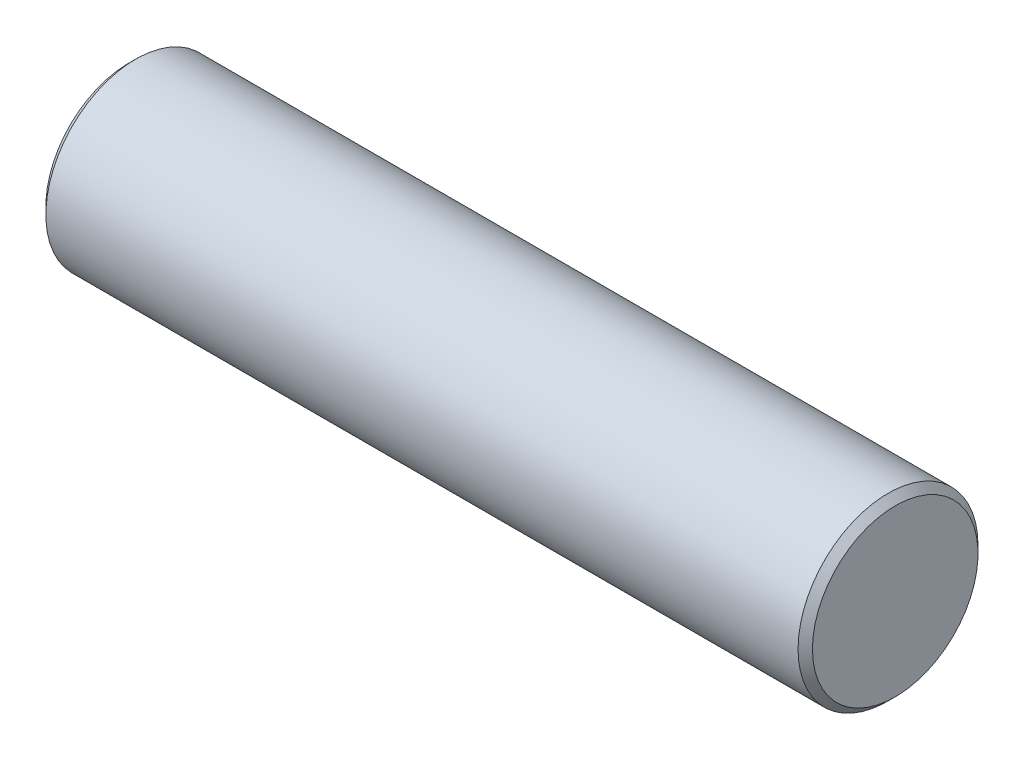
ISO-10303-21;
HEADER;
FILE_DESCRIPTION(('STEP AP214'),'2;1');
FILE_NAME('part.step','',(''),(''),'','','');
FILE_SCHEMA(('AUTOMOTIVE_DESIGN { 1 0 10303 214 1 1 1 1 }'));
ENDSEC;
DATA;
#1=APPLICATION_CONTEXT('core data for automotive mechanical design processes');
#2=APPLICATION_PROTOCOL_DEFINITION('international standard','automotive_design',2000,#1);
#3=PRODUCT_CONTEXT('',#1,'mechanical');
#4=PRODUCT('Part','Part','',(#3));
#5=PRODUCT_RELATED_PRODUCT_CATEGORY('part','',(#4));
#6=PRODUCT_DEFINITION_FORMATION('','',#4);
#7=PRODUCT_DEFINITION_CONTEXT('part definition',#1,'design');
#8=PRODUCT_DEFINITION('design','',#6,#7);
#9=PRODUCT_DEFINITION_SHAPE('','',#8);
#10=(LENGTH_UNIT() NAMED_UNIT(*) SI_UNIT(.MILLI.,.METRE.));
#11=(NAMED_UNIT(*) PLANE_ANGLE_UNIT() SI_UNIT($,.RADIAN.));
#12=(NAMED_UNIT(*) SI_UNIT($,.STERADIAN.) SOLID_ANGLE_UNIT());
#13=UNCERTAINTY_MEASURE_WITH_UNIT(LENGTH_MEASURE(1.E-05),#10,'distance_accuracy_value','');
#14=(GEOMETRIC_REPRESENTATION_CONTEXT(3) GLOBAL_UNCERTAINTY_ASSIGNED_CONTEXT((#13)) GLOBAL_UNIT_ASSIGNED_CONTEXT((#10,
#11,#12)) REPRESENTATION_CONTEXT('',''));
#15=CARTESIAN_POINT('',(0.,0.,0.));
#16=DIRECTION('',(0.,0.,1.));
#17=DIRECTION('',(1.,0.,0.));
#18=AXIS2_PLACEMENT_3D('',#15,#16,#17);
#19=CARTESIAN_POINT('',(0.,0.,0.));
#20=DIRECTION('',(1.,0.,0.));
#21=DIRECTION('',(0.,0.,-1.));
#22=AXIS2_PLACEMENT_3D('',#19,#20,#21);
#23=PLANE('',#22);
#24=CARTESIAN_POINT('',(-5.6843418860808E-11,0.,0.));
#25=DIRECTION('',(1.,0.,0.));
#26=DIRECTION('',(0.,0.,-1.));
#27=AXIS2_PLACEMENT_3D('',#24,#25,#26);
#28=CIRCLE('',#27,2.29999999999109);
#29=CARTESIAN_POINT('',(-5.6843418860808E-11,0.,-2.29999999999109));
#30=VERTEX_POINT('',#29);
#31=EDGE_CURVE('E17',#30,#30,#28,.T.);
#32=ORIENTED_EDGE('',*,*,#31,.F.);
#33=EDGE_LOOP('',(#32));
#34=FACE_BOUND('',#33,.T.);
#35=ADVANCED_FACE('F14',(#34),#23,.F.);
#36=CARTESIAN_POINT('',(21.3,0.,0.));
#37=DIRECTION('',(1.,0.,0.));
#38=DIRECTION('',(0.,0.,-1.));
#39=AXIS2_PLACEMENT_3D('',#36,#37,#38);
#40=PLANE('',#39);
#41=CARTESIAN_POINT('',(21.2999999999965,0.,0.));
#42=DIRECTION('',(-1.,0.,0.));
#43=DIRECTION('',(0.,0.,1.));
#44=AXIS2_PLACEMENT_3D('',#41,#42,#43);
#45=CIRCLE('',#44,2.29999999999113);
#46=CARTESIAN_POINT('',(21.2999999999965,0.,2.29999999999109));
#47=VERTEX_POINT('',#46);
#48=EDGE_CURVE('E26',#47,#47,#45,.T.);
#49=ORIENTED_EDGE('',*,*,#48,.F.);
#50=EDGE_LOOP('',(#49));
#51=FACE_BOUND('',#50,.T.);
#52=ADVANCED_FACE('F37',(#51),#40,.T.);
#53=CARTESIAN_POINT('',(0.200000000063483,0.,0.));
#54=DIRECTION('',(1.,0.,0.));
#55=DIRECTION('',(0.,0.,-1.));
#56=AXIS2_PLACEMENT_3D('',#53,#54,#55);
#57=CONICAL_SURFACE('',#56,2.50000000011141,0.785398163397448);
#58=CARTESIAN_POINT('',(0.199999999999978,0.,0.));
#59=DIRECTION('',(1.,0.,0.));
#60=DIRECTION('',(0.,0.,-1.));
#61=AXIS2_PLACEMENT_3D('',#58,#59,#60);
#62=CIRCLE('',#61,2.5);
#63=CARTESIAN_POINT('',(0.199999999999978,0.,-2.5));
#64=VERTEX_POINT('',#63);
#65=EDGE_CURVE('E21',#64,#64,#62,.T.);
#66=ORIENTED_EDGE('',*,*,#65,.F.);
#67=EDGE_LOOP('',(#66));
#68=FACE_BOUND('',#67,.T.);
#69=ORIENTED_EDGE('',*,*,#31,.T.);
#70=EDGE_LOOP('',(#69));
#71=FACE_BOUND('',#70,.T.);
#72=ADVANCED_FACE('F34',(#68,#71),#57,.T.);
#73=CARTESIAN_POINT('',(21.1000000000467,0.,0.));
#74=DIRECTION('',(-1.,0.,0.));
#75=DIRECTION('',(0.,0.,1.));
#76=AXIS2_PLACEMENT_3D('',#73,#74,#75);
#77=CONICAL_SURFACE('',#76,2.49999999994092,0.785398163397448);
#78=CARTESIAN_POINT('',(21.1,0.,0.));
#79=DIRECTION('',(1.,0.,0.));
#80=DIRECTION('',(0.,0.,-1.));
#81=AXIS2_PLACEMENT_3D('',#78,#79,#80);
#82=CIRCLE('',#81,2.5);
#83=CARTESIAN_POINT('',(21.1,0.,-2.5));
#84=VERTEX_POINT('',#83);
#85=EDGE_CURVE('E10',#84,#84,#82,.F.);
#86=ORIENTED_EDGE('',*,*,#85,.F.);
#87=EDGE_LOOP('',(#86));
#88=FACE_BOUND('',#87,.T.);
#89=ORIENTED_EDGE('',*,*,#48,.T.);
#90=EDGE_LOOP('',(#89));
#91=FACE_BOUND('',#90,.T.);
#92=ADVANCED_FACE('F45',(#88,#91),#77,.T.);
#93=CARTESIAN_POINT('',(-1.06499999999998,0.,0.));
#94=DIRECTION('',(1.,0.,0.));
#95=DIRECTION('',(0.,0.,-1.));
#96=AXIS2_PLACEMENT_3D('',#93,#94,#95);
#97=CYLINDRICAL_SURFACE('',#96,2.5);
#98=ORIENTED_EDGE('',*,*,#85,.T.);
#99=EDGE_LOOP('',(#98));
#100=FACE_BOUND('',#99,.T.);
#101=ORIENTED_EDGE('',*,*,#65,.T.);
#102=EDGE_LOOP('',(#101));
#103=FACE_BOUND('',#102,.T.);
#104=ADVANCED_FACE('F43',(#100,#103),#97,.T.);
#105=CLOSED_SHELL('',(#35,#52,#72,#92,#104));
#106=MANIFOLD_SOLID_BREP('B1',#105);
#107=ADVANCED_BREP_SHAPE_REPRESENTATION('',(#18,#106),#14);
#108=SHAPE_DEFINITION_REPRESENTATION(#9,#107);
ENDSEC;
END-ISO-10303-21;
